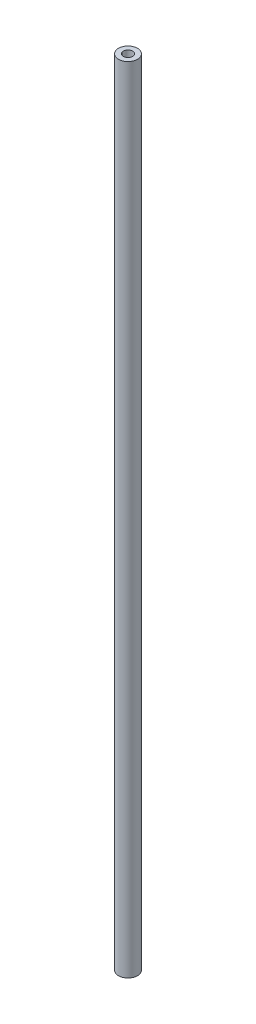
ISO-10303-21;
HEADER;
FILE_DESCRIPTION(('STEP AP214'),'2;1');
FILE_NAME('part.step','',(''),(''),'','','');
FILE_SCHEMA(('AUTOMOTIVE_DESIGN { 1 0 10303 214 1 1 1 1 }'));
ENDSEC;
DATA;
#1=APPLICATION_CONTEXT('core data for automotive mechanical design processes');
#2=APPLICATION_PROTOCOL_DEFINITION('international standard','automotive_design',2000,#1);
#3=PRODUCT_CONTEXT('',#1,'mechanical');
#4=PRODUCT('Part','Part','',(#3));
#5=PRODUCT_RELATED_PRODUCT_CATEGORY('part','',(#4));
#6=PRODUCT_DEFINITION_FORMATION('','',#4);
#7=PRODUCT_DEFINITION_CONTEXT('part definition',#1,'design');
#8=PRODUCT_DEFINITION('design','',#6,#7);
#9=PRODUCT_DEFINITION_SHAPE('','',#8);
#10=(LENGTH_UNIT() NAMED_UNIT(*) SI_UNIT(.MILLI.,.METRE.));
#11=(NAMED_UNIT(*) PLANE_ANGLE_UNIT() SI_UNIT($,.RADIAN.));
#12=(NAMED_UNIT(*) SI_UNIT($,.STERADIAN.) SOLID_ANGLE_UNIT());
#13=UNCERTAINTY_MEASURE_WITH_UNIT(LENGTH_MEASURE(1.E-05),#10,'distance_accuracy_value','');
#14=(GEOMETRIC_REPRESENTATION_CONTEXT(3) GLOBAL_UNCERTAINTY_ASSIGNED_CONTEXT((#13)) GLOBAL_UNIT_ASSIGNED_CONTEXT((#10,
#11,#12)) REPRESENTATION_CONTEXT('',''));
#15=CARTESIAN_POINT('',(0.,0.,0.));
#16=DIRECTION('',(0.,0.,1.));
#17=DIRECTION('',(1.,0.,0.));
#18=AXIS2_PLACEMENT_3D('',#15,#16,#17);
#19=CARTESIAN_POINT('',(0.,1828.8,0.));
#20=DIRECTION('',(0.,1.,0.));
#21=DIRECTION('',(0.,0.,1.));
#22=AXIS2_PLACEMENT_3D('',#19,#20,#21);
#23=PLANE('',#22);
#24=CARTESIAN_POINT('',(0.,1828.8,0.));
#25=DIRECTION('',(0.,1.,0.));
#26=DIRECTION('',(0.,0.,1.));
#27=AXIS2_PLACEMENT_3D('',#24,#25,#26);
#28=CIRCLE('',#27,21.971);
#29=CARTESIAN_POINT('',(0.,1828.8,21.971));
#30=VERTEX_POINT('',#29);
#31=EDGE_CURVE('E10',#30,#30,#28,.T.);
#32=ORIENTED_EDGE('',*,*,#31,.T.);
#33=EDGE_LOOP('',(#32));
#34=FACE_BOUND('',#33,.T.);
#35=CARTESIAN_POINT('',(0.,1828.8,0.));
#36=DIRECTION('',(0.,1.,0.));
#37=DIRECTION('',(0.,0.,1.));
#38=AXIS2_PLACEMENT_3D('',#35,#36,#37);
#39=CIRCLE('',#38,10.668);
#40=CARTESIAN_POINT('',(0.,1828.8,10.668));
#41=VERTEX_POINT('',#40);
#42=EDGE_CURVE('E54',#41,#41,#39,.T.);
#43=ORIENTED_EDGE('',*,*,#42,.F.);
#44=EDGE_LOOP('',(#43));
#45=FACE_BOUND('',#44,.T.);
#46=ADVANCED_FACE('F43',(#34,#45),#23,.T.);
#47=CARTESIAN_POINT('',(0.,0.,0.));
#48=DIRECTION('',(0.,1.,0.));
#49=DIRECTION('',(0.,0.,1.));
#50=AXIS2_PLACEMENT_3D('',#47,#48,#49);
#51=PLANE('',#50);
#52=CARTESIAN_POINT('',(0.,0.,0.));
#53=DIRECTION('',(0.,1.,0.));
#54=DIRECTION('',(0.,0.,1.));
#55=AXIS2_PLACEMENT_3D('',#52,#53,#54);
#56=CIRCLE('',#55,21.971);
#57=CARTESIAN_POINT('',(0.,0.,21.971));
#58=VERTEX_POINT('',#57);
#59=EDGE_CURVE('E47',#58,#58,#56,.T.);
#60=ORIENTED_EDGE('',*,*,#59,.F.);
#61=EDGE_LOOP('',(#60));
#62=FACE_BOUND('',#61,.T.);
#63=CARTESIAN_POINT('',(0.,0.,0.));
#64=DIRECTION('',(0.,1.,0.));
#65=DIRECTION('',(0.,0.,1.));
#66=AXIS2_PLACEMENT_3D('',#63,#64,#65);
#67=CIRCLE('',#66,10.668);
#68=CARTESIAN_POINT('',(0.,0.,10.668));
#69=VERTEX_POINT('',#68);
#70=EDGE_CURVE('E56',#69,#69,#67,.T.);
#71=ORIENTED_EDGE('',*,*,#70,.T.);
#72=EDGE_LOOP('',(#71));
#73=FACE_BOUND('',#72,.T.);
#74=ADVANCED_FACE('F66',(#62,#73),#51,.F.);
#75=CARTESIAN_POINT('',(0.,1828.8,0.));
#76=DIRECTION('',(0.,-1.,0.));
#77=DIRECTION('',(0.,0.,-1.));
#78=AXIS2_PLACEMENT_3D('',#75,#76,#77);
#79=CYLINDRICAL_SURFACE('',#78,21.971);
#80=ORIENTED_EDGE('',*,*,#31,.F.);
#81=EDGE_LOOP('',(#80));
#82=FACE_BOUND('',#81,.T.);
#83=ORIENTED_EDGE('',*,*,#59,.T.);
#84=EDGE_LOOP('',(#83));
#85=FACE_BOUND('',#84,.T.);
#86=ADVANCED_FACE('F45',(#82,#85),#79,.T.);
#87=CARTESIAN_POINT('',(0.,1828.8,0.));
#88=DIRECTION('',(0.,-1.,0.));
#89=DIRECTION('',(0.,0.,-1.));
#90=AXIS2_PLACEMENT_3D('',#87,#88,#89);
#91=CYLINDRICAL_SURFACE('',#90,10.668);
#92=ORIENTED_EDGE('',*,*,#42,.T.);
#93=EDGE_LOOP('',(#92));
#94=FACE_BOUND('',#93,.T.);
#95=ORIENTED_EDGE('',*,*,#70,.F.);
#96=EDGE_LOOP('',(#95));
#97=FACE_BOUND('',#96,.T.);
#98=ADVANCED_FACE('F62',(#94,#97),#91,.F.);
#99=CLOSED_SHELL('',(#46,#74,#86,#98));
#100=MANIFOLD_SOLID_BREP('B2',#99);
#101=ADVANCED_BREP_SHAPE_REPRESENTATION('',(#18,#100),#14);
#102=SHAPE_DEFINITION_REPRESENTATION(#9,#101);
ENDSEC;
END-ISO-10303-21;
